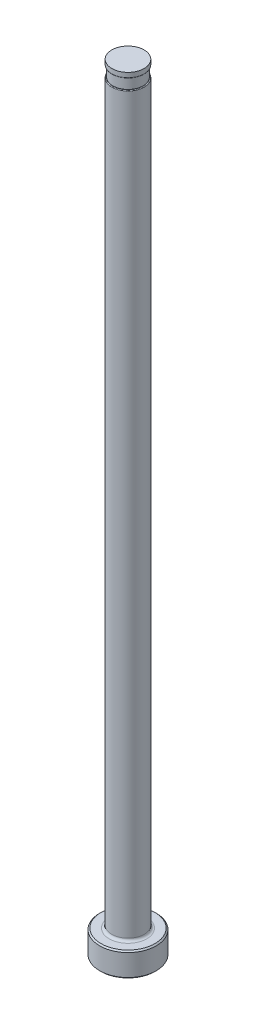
ISO-10303-21;
HEADER;
FILE_DESCRIPTION(('STEP AP214'),'2;1');
FILE_NAME('part.step','',(''),(''),'','','');
FILE_SCHEMA(('AUTOMOTIVE_DESIGN { 1 0 10303 214 1 1 1 1 }'));
ENDSEC;
DATA;
#1=APPLICATION_CONTEXT('core data for automotive mechanical design processes');
#2=APPLICATION_PROTOCOL_DEFINITION('international standard','automotive_design',2000,#1);
#3=PRODUCT_CONTEXT('',#1,'mechanical');
#4=PRODUCT('Part','Part','',(#3));
#5=PRODUCT_RELATED_PRODUCT_CATEGORY('part','',(#4));
#6=PRODUCT_DEFINITION_FORMATION('','',#4);
#7=PRODUCT_DEFINITION_CONTEXT('part definition',#1,'design');
#8=PRODUCT_DEFINITION('design','',#6,#7);
#9=PRODUCT_DEFINITION_SHAPE('','',#8);
#10=(LENGTH_UNIT() NAMED_UNIT(*) SI_UNIT(.MILLI.,.METRE.));
#11=(NAMED_UNIT(*) PLANE_ANGLE_UNIT() SI_UNIT($,.RADIAN.));
#12=(NAMED_UNIT(*) SI_UNIT($,.STERADIAN.) SOLID_ANGLE_UNIT());
#13=UNCERTAINTY_MEASURE_WITH_UNIT(LENGTH_MEASURE(1.E-05),#10,'distance_accuracy_value','');
#14=(GEOMETRIC_REPRESENTATION_CONTEXT(3) GLOBAL_UNCERTAINTY_ASSIGNED_CONTEXT((#13)) GLOBAL_UNIT_ASSIGNED_CONTEXT((#10,
#11,#12)) REPRESENTATION_CONTEXT('',''));
#15=CARTESIAN_POINT('',(0.,0.,0.));
#16=DIRECTION('',(0.,0.,1.));
#17=DIRECTION('',(1.,0.,0.));
#18=AXIS2_PLACEMENT_3D('',#15,#16,#17);
#19=CARTESIAN_POINT('',(-3.17499999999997,151.384,0.));
#20=DIRECTION('',(0.,1.,0.));
#21=DIRECTION('',(0.,0.,1.));
#22=AXIS2_PLACEMENT_3D('',#19,#20,#21);
#23=PLANE('',#22);
#24=CARTESIAN_POINT('',(0.,151.384,0.));
#25=DIRECTION('',(0.,1.,0.));
#26=DIRECTION('',(0.,0.,1.));
#27=AXIS2_PLACEMENT_3D('',#24,#25,#26);
#28=CIRCLE('',#27,3.04291999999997);
#29=CARTESIAN_POINT('',(0.,151.384,3.04291999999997));
#30=VERTEX_POINT('',#29);
#31=EDGE_CURVE('E11',#30,#30,#28,.F.);
#32=ORIENTED_EDGE('',*,*,#31,.T.);
#33=EDGE_LOOP('',(#32));
#34=FACE_BOUND('',#33,.T.);
#35=CARTESIAN_POINT('',(0.,151.384,0.));
#36=DIRECTION('',(0.,1.,0.));
#37=DIRECTION('',(0.,0.,1.));
#38=AXIS2_PLACEMENT_3D('',#35,#36,#37);
#39=CIRCLE('',#38,2.97179999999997);
#40=CARTESIAN_POINT('',(0.,151.384,2.97179999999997));
#41=VERTEX_POINT('',#40);
#42=EDGE_CURVE('E78',#41,#41,#39,.T.);
#43=ORIENTED_EDGE('',*,*,#42,.T.);
#44=EDGE_LOOP('',(#43));
#45=FACE_BOUND('',#44,.T.);
#46=ADVANCED_FACE('F36',(#34,#45),#23,.F.);
#47=CARTESIAN_POINT('',(0.,259.958771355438,0.));
#48=DIRECTION('',(0.,1.,0.));
#49=DIRECTION('',(0.,0.,1.));
#50=AXIS2_PLACEMENT_3D('',#47,#48,#49);
#51=CYLINDRICAL_SURFACE('',#50,3.17499999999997);
#52=DIRECTION('',(0.,1.,0.));
#53=VECTOR('',#52,1.);
#54=CARTESIAN_POINT('',(-2.97179999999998,259.958771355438,-1.11759999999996));
#55=LINE('',#54,#53);
#56=CARTESIAN_POINT('',(-2.97179999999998,149.225,-1.11759999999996));
#57=VERTEX_POINT('',#56);
#58=CARTESIAN_POINT('',(-2.97179999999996,86.868,-1.11760000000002));
#59=VERTEX_POINT('',#58);
#60=EDGE_CURVE('E73',#57,#59,#55,.F.);
#61=ORIENTED_EDGE('',*,*,#60,.F.);
#62=CARTESIAN_POINT('',(0.,149.225,0.));
#63=DIRECTION('',(0.,-1.,0.));
#64=DIRECTION('',(0.,0.,-1.));
#65=AXIS2_PLACEMENT_3D('',#62,#63,#64);
#66=CIRCLE('',#65,3.17499999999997);
#67=CARTESIAN_POINT('',(-2.97179999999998,149.225,1.11759999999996));
#68=VERTEX_POINT('',#67);
#69=EDGE_CURVE('E51',#57,#68,#66,.T.);
#70=ORIENTED_EDGE('',*,*,#69,.T.);
#71=DIRECTION('',(0.,1.,0.));
#72=VECTOR('',#71,1.);
#73=CARTESIAN_POINT('',(-2.97179999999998,259.958771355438,1.11759999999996));
#74=LINE('',#73,#72);
#75=CARTESIAN_POINT('',(-2.97179999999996,86.868,1.11760000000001));
#76=VERTEX_POINT('',#75);
#77=EDGE_CURVE('E84',#76,#68,#74,.T.);
#78=ORIENTED_EDGE('',*,*,#77,.F.);
#79=CARTESIAN_POINT('',(-2.97179999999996,86.868,-1.11760000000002));
#80=CARTESIAN_POINT('',(-2.97179783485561,86.8368492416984,-1.11759841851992));
#81=CARTESIAN_POINT('',(-2.97225900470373,86.8057131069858,-1.11638031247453));
#82=CARTESIAN_POINT('',(-2.97408412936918,86.7436581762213,-1.11151181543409));
#83=CARTESIAN_POINT('',(-2.9754480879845,86.7127393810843,-1.10786141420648));
#84=CARTESIAN_POINT('',(-2.98085437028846,86.6206586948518,-1.09327356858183));
#85=CARTESIAN_POINT('',(-2.98621120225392,86.5601035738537,-1.07869946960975));
#86=CARTESIAN_POINT('',(-2.99989040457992,86.4424361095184,-1.0400472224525));
#87=CARTESIAN_POINT('',(-3.0082151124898,86.385326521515,-1.01596158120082));
#88=CARTESIAN_POINT('',(-3.02694285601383,86.276241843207,-0.958720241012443));
#89=CARTESIAN_POINT('',(-3.03734492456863,86.2242643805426,-0.925568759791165));
#90=CARTESIAN_POINT('',(-3.05902445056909,86.1272383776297,-0.851164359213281));
#91=CARTESIAN_POINT('',(-3.07029576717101,86.082146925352,-0.809965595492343));
#92=CARTESIAN_POINT('',(-3.09254226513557,85.9996893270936,-0.720370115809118));
#93=CARTESIAN_POINT('',(-3.10351739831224,85.9623244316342,-0.671972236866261));
#94=CARTESIAN_POINT('',(-3.12390298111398,85.8964529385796,-0.5696942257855));
#95=CARTESIAN_POINT('',(-3.13332395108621,85.8678855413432,-0.51585530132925));
#96=CARTESIAN_POINT('',(-3.14970808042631,85.8198047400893,-0.403931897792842));
#97=CARTESIAN_POINT('',(-3.15667118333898,85.8002915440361,-0.345847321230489));
#98=CARTESIAN_POINT('',(-3.16748231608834,85.7704813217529,-0.226501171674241));
#99=CARTESIAN_POINT('',(-3.171300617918,85.7602721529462,-0.16521497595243));
#100=CARTESIAN_POINT('',(-3.17532797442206,85.7495133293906,-0.0416799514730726));
#101=CARTESIAN_POINT('',(-3.17553664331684,85.7489647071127,0.0205689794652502));
#102=CARTESIAN_POINT('',(-3.17230405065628,85.7575855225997,0.145017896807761));
#103=CARTESIAN_POINT('',(-3.16882082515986,85.7668666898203,0.207209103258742));
#104=CARTESIAN_POINT('',(-3.15849643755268,85.7952036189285,0.329033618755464));
#105=CARTESIAN_POINT('',(-3.15165544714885,85.8142588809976,0.388667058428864));
#106=CARTESIAN_POINT('',(-3.13536379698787,85.8617683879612,0.503459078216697));
#107=CARTESIAN_POINT('',(-3.12592155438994,85.8901923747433,0.558631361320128));
#108=CARTESIAN_POINT('',(-3.10544176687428,85.9558905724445,0.663093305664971));
#109=CARTESIAN_POINT('',(-3.0944044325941,85.9931636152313,0.712383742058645));
#110=CARTESIAN_POINT('',(-3.07210838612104,86.075112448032,0.803076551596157));
#111=CARTESIAN_POINT('',(-3.06085457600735,86.119683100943,0.844575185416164));
#112=CARTESIAN_POINT('',(-3.03920760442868,86.2153924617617,0.919437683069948));
#113=CARTESIAN_POINT('',(-3.02881454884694,86.266531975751,0.952800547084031));
#114=CARTESIAN_POINT('',(-3.01003274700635,86.3737633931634,1.01056985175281));
#115=CARTESIAN_POINT('',(-3.00163816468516,86.4298402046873,1.03500248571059));
#116=CARTESIAN_POINT('',(-2.987687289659,86.5454874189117,1.0746137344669));
#117=CARTESIAN_POINT('',(-2.98212915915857,86.6050555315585,1.08979834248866));
#118=CARTESIAN_POINT('',(-2.97612776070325,86.6989133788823,1.10603958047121));
#119=CARTESIAN_POINT('',(-2.97450869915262,86.732597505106,1.11037745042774));
#120=CARTESIAN_POINT('',(-2.9723439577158,86.8001830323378,1.11615426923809));
#121=CARTESIAN_POINT('',(-2.97179623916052,86.834083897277,1.11759872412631));
#122=CARTESIAN_POINT('',(-2.97179999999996,86.868,1.11760000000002));
#123=B_SPLINE_CURVE_WITH_KNOTS('',3,(#79,#80,#81,#82,#83,#84,#85,#86,#87,#88,#89,#90,#91,#92,
#93,#94,#95,#96,#97,#98,#99,#100,#101,#102,#103,#104,#105,#106,#107,#108,#109,#110,#111,#112,
#113,#114,#115,#116,#117,#118,#119,#120,#121,#122),.UNSPECIFIED.,.F.,.F.,(4,2,2,2,2,2,2,2,2,2,2,
2,2,2,2,2,2,2,2,2,2,4),(0.,0.0933958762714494,0.186792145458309,0.373380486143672,
0.56011611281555,0.746765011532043,0.932198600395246,1.11766217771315,1.30181365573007,
1.48596936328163,1.67184654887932,1.85774359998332,2.04577654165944,2.23379986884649,
2.42122179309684,2.60861899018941,2.79352185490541,2.97844743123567,3.16282616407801,
3.34708528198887,3.448962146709,3.55064495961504),.UNSPECIFIED.);
#124=EDGE_CURVE('E81',#59,#76,#123,.T.);
#125=ORIENTED_EDGE('',*,*,#124,.F.);
#126=EDGE_LOOP('',(#61,#70,#78,#125));
#127=FACE_BOUND('',#126,.T.);
#128=CARTESIAN_POINT('',(0.,5.25779999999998,0.));
#129=DIRECTION('',(0.,1.,0.));
#130=DIRECTION('',(0.,0.,1.));
#131=AXIS2_PLACEMENT_3D('',#128,#129,#130);
#132=CIRCLE('',#131,3.17499999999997);
#133=CARTESIAN_POINT('',(0.,5.25779999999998,3.17499999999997));
#134=VERTEX_POINT('',#133);
#135=EDGE_CURVE('E116',#134,#134,#132,.T.);
#136=ORIENTED_EDGE('',*,*,#135,.T.);
#137=EDGE_LOOP('',(#136));
#138=FACE_BOUND('',#137,.T.);
#139=ADVANCED_FACE('F82',(#127,#138),#51,.T.);
#140=CARTESIAN_POINT('',(0.,0.,0.));
#141=DIRECTION('',(0.,-1.,0.));
#142=DIRECTION('',(0.,0.,-1.));
#143=AXIS2_PLACEMENT_3D('',#140,#141,#142);
#144=PLANE('',#143);
#145=CARTESIAN_POINT('',(0.,0.,0.));
#146=DIRECTION('',(0.,-1.,0.));
#147=DIRECTION('',(0.,0.,-1.));
#148=AXIS2_PLACEMENT_3D('',#145,#146,#147);
#149=CIRCLE('',#148,5.29589999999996);
#150=CARTESIAN_POINT('',(0.,0.,-5.29589999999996));
#151=VERTEX_POINT('',#150);
#152=EDGE_CURVE('E113',#151,#151,#149,.T.);
#153=ORIENTED_EDGE('',*,*,#152,.T.);
#154=EDGE_LOOP('',(#153));
#155=FACE_BOUND('',#154,.T.);
#156=ADVANCED_FACE('F192',(#155),#144,.T.);
#157=CARTESIAN_POINT('',(0.,259.958771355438,0.));
#158=DIRECTION('',(0.,1.,0.));
#159=DIRECTION('',(0.,0.,1.));
#160=AXIS2_PLACEMENT_3D('',#157,#158,#159);
#161=CYLINDRICAL_SURFACE('',#160,5.54989999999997);
#162=CARTESIAN_POINT('',(0.,4.49579999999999,0.));
#163=DIRECTION('',(0.,1.,0.));
#164=DIRECTION('',(0.,0.,1.));
#165=AXIS2_PLACEMENT_3D('',#162,#163,#164);
#166=CIRCLE('',#165,5.54989999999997);
#167=CARTESIAN_POINT('',(0.,4.49579999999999,5.54989999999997));
#168=VERTEX_POINT('',#167);
#169=EDGE_CURVE('E110',#168,#168,#166,.F.);
#170=ORIENTED_EDGE('',*,*,#169,.T.);
#171=EDGE_LOOP('',(#170));
#172=FACE_BOUND('',#171,.T.);
#173=CARTESIAN_POINT('',(0.,0.253999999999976,0.));
#174=DIRECTION('',(0.,-1.,0.));
#175=DIRECTION('',(0.,0.,-1.));
#176=AXIS2_PLACEMENT_3D('',#173,#174,#175);
#177=CIRCLE('',#176,5.54989999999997);
#178=CARTESIAN_POINT('',(0.,0.253999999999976,-5.54989999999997));
#179=VERTEX_POINT('',#178);
#180=EDGE_CURVE('E107',#179,#179,#177,.F.);
#181=ORIENTED_EDGE('',*,*,#180,.T.);
#182=EDGE_LOOP('',(#181));
#183=FACE_BOUND('',#182,.T.);
#184=ADVANCED_FACE('F195',(#172,#183),#161,.T.);
#185=CARTESIAN_POINT('',(-5.54989999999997,4.7498,0.));
#186=DIRECTION('',(0.,1.,0.));
#187=DIRECTION('',(0.,0.,1.));
#188=AXIS2_PLACEMENT_3D('',#185,#186,#187);
#189=PLANE('',#188);
#190=CARTESIAN_POINT('',(0.,4.7498,0.));
#191=DIRECTION('',(0.,1.,0.));
#192=DIRECTION('',(0.,0.,1.));
#193=AXIS2_PLACEMENT_3D('',#190,#191,#192);
#194=CIRCLE('',#193,3.68299999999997);
#195=CARTESIAN_POINT('',(0.,4.7498,3.68299999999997));
#196=VERTEX_POINT('',#195);
#197=EDGE_CURVE('E87',#196,#196,#194,.F.);
#198=ORIENTED_EDGE('',*,*,#197,.T.);
#199=EDGE_LOOP('',(#198));
#200=FACE_BOUND('',#199,.T.);
#201=CARTESIAN_POINT('',(0.,4.7498,0.));
#202=DIRECTION('',(0.,1.,0.));
#203=DIRECTION('',(0.,0.,1.));
#204=AXIS2_PLACEMENT_3D('',#201,#202,#203);
#205=CIRCLE('',#204,5.29589999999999);
#206=CARTESIAN_POINT('',(0.,4.7498,5.29589999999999));
#207=VERTEX_POINT('',#206);
#208=EDGE_CURVE('E104',#207,#207,#205,.T.);
#209=ORIENTED_EDGE('',*,*,#208,.T.);
#210=EDGE_LOOP('',(#209));
#211=FACE_BOUND('',#210,.T.);
#212=ADVANCED_FACE('F190',(#200,#211),#189,.T.);
#213=CARTESIAN_POINT('',(0.,4.74980000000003,0.));
#214=DIRECTION('',(0.,-1.,0.));
#215=DIRECTION('',(0.,0.,-1.));
#216=AXIS2_PLACEMENT_3D('',#213,#214,#215);
#217=CONICAL_SURFACE('',#216,5.29589999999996,0.785398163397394);
#218=ORIENTED_EDGE('',*,*,#169,.F.);
#219=EDGE_LOOP('',(#218));
#220=FACE_BOUND('',#219,.T.);
#221=ORIENTED_EDGE('',*,*,#208,.F.);
#222=EDGE_LOOP('',(#221));
#223=FACE_BOUND('',#222,.T.);
#224=ADVANCED_FACE('F186',(#220,#223),#217,.T.);
#225=CARTESIAN_POINT('',(0.,0.253999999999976,0.));
#226=DIRECTION('',(0.,1.,0.));
#227=DIRECTION('',(0.,0.,1.));
#228=AXIS2_PLACEMENT_3D('',#225,#226,#227);
#229=CONICAL_SURFACE('',#228,5.54989999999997,0.785398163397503);
#230=ORIENTED_EDGE('',*,*,#152,.F.);
#231=EDGE_LOOP('',(#230));
#232=FACE_BOUND('',#231,.T.);
#233=ORIENTED_EDGE('',*,*,#180,.F.);
#234=EDGE_LOOP('',(#233));
#235=FACE_BOUND('',#234,.T.);
#236=ADVANCED_FACE('F182',(#232,#235),#229,.T.);
#237=CARTESIAN_POINT('',(0.,5.25779999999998,0.));
#238=DIRECTION('',(0.,1.,0.));
#239=DIRECTION('',(0.,0.,1.));
#240=AXIS2_PLACEMENT_3D('',#237,#238,#239);
#241=TOROIDAL_SURFACE('',#240,3.68299999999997,0.508);
#242=ORIENTED_EDGE('',*,*,#197,.F.);
#243=EDGE_LOOP('',(#242));
#244=FACE_BOUND('',#243,.T.);
#245=ORIENTED_EDGE('',*,*,#135,.F.);
#246=EDGE_LOOP('',(#245));
#247=FACE_BOUND('',#246,.T.);
#248=ADVANCED_FACE('F147',(#244,#247),#241,.F.);
#249=CARTESIAN_POINT('',(-3.17499999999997,149.352,0.));
#250=DIRECTION('',(0.,-1.,0.));
#251=DIRECTION('',(0.,0.,-1.));
#252=AXIS2_PLACEMENT_3D('',#249,#250,#251);
#253=PLANE('',#252);
#254=DIRECTION('',(0.,0.,1.));
#255=VECTOR('',#254,1.);
#256=CARTESIAN_POINT('',(-2.97179999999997,149.352,0.));
#257=LINE('',#256,#255);
#258=CARTESIAN_POINT('',(-2.97179999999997,149.352,0.));
#259=VERTEX_POINT('',#258);
#260=CARTESIAN_POINT('',(-2.97179999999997,149.352,0.677280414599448));
#261=VERTEX_POINT('',#260);
#262=EDGE_CURVE('E90',#259,#261,#257,.T.);
#263=ORIENTED_EDGE('',*,*,#262,.T.);
#264=CARTESIAN_POINT('',(0.,149.352,0.));
#265=DIRECTION('',(0.,-1.,0.));
#266=DIRECTION('',(0.,0.,-1.));
#267=AXIS2_PLACEMENT_3D('',#264,#265,#266);
#268=CIRCLE('',#267,3.04799999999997);
#269=CARTESIAN_POINT('',(-2.97179999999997,149.352,-0.677280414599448));
#270=VERTEX_POINT('',#269);
#271=EDGE_CURVE('E86',#261,#270,#268,.F.);
#272=ORIENTED_EDGE('',*,*,#271,.T.);
#273=EDGE_CURVE('E79',#270,#259,#257,.T.);
#274=ORIENTED_EDGE('',*,*,#273,.T.);
#275=CARTESIAN_POINT('',(0.,149.352,0.));
#276=DIRECTION('',(0.,1.,0.));
#277=DIRECTION('',(0.,0.,1.));
#278=AXIS2_PLACEMENT_3D('',#275,#276,#277);
#279=CIRCLE('',#278,2.97179999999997);
#280=EDGE_CURVE('E101',#259,#259,#279,.T.);
#281=ORIENTED_EDGE('',*,*,#280,.F.);
#282=EDGE_LOOP('',(#263,#272,#274,#281));
#283=FACE_BOUND('',#282,.T.);
#284=ADVANCED_FACE('F144',(#283),#253,.F.);
#285=CARTESIAN_POINT('',(0.,153.448281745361,0.));
#286=DIRECTION('',(0.,1.,0.));
#287=DIRECTION('',(0.,0.,1.));
#288=AXIS2_PLACEMENT_3D('',#285,#286,#287);
#289=CYLINDRICAL_SURFACE('',#288,2.97179999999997);
#290=ORIENTED_EDGE('',*,*,#42,.F.);
#291=EDGE_LOOP('',(#290));
#292=FACE_BOUND('',#291,.T.);
#293=ORIENTED_EDGE('',*,*,#280,.T.);
#294=EDGE_LOOP('',(#293));
#295=FACE_BOUND('',#294,.T.);
#296=ADVANCED_FACE('F141',(#292,#295),#289,.T.);
#297=CARTESIAN_POINT('',(-2.97179999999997,150.368,-5.54989999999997));
#298=DIRECTION('',(1.,0.,0.));
#299=DIRECTION('',(0.,1.,0.));
#300=AXIS2_PLACEMENT_3D('',#297,#298,#299);
#301=PLANE('',#300);
#302=ORIENTED_EDGE('',*,*,#273,.F.);
#303=CARTESIAN_POINT('',(-2.97179999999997,149.352,-0.677280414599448));
#304=CARTESIAN_POINT('',(-2.97179999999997,149.351991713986,-0.698495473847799));
#305=CARTESIAN_POINT('',(-2.97179999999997,149.351736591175,-0.719716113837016));
#306=CARTESIAN_POINT('',(-2.97179999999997,149.350538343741,-0.762179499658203));
#307=CARTESIAN_POINT('',(-2.97179999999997,149.349593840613,-0.78342220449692));
#308=CARTESIAN_POINT('',(-2.97179999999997,149.346820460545,-0.825863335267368));
#309=CARTESIAN_POINT('',(-2.97179999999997,149.344991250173,-0.847061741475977));
#310=CARTESIAN_POINT('',(-2.97179999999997,149.340151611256,-0.889310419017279));
#311=CARTESIAN_POINT('',(-2.97179999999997,149.337141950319,-0.910360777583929));
#312=CARTESIAN_POINT('',(-2.97179999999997,149.329222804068,-0.953695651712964));
#313=CARTESIAN_POINT('',(-2.97179999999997,149.324192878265,-0.975960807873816));
#314=CARTESIAN_POINT('',(-2.97179999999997,149.314052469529,-1.00993113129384));
#315=CARTESIAN_POINT('',(-2.97179999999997,149.309967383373,-1.02193961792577));
#316=CARTESIAN_POINT('',(-2.97179999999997,149.300509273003,-1.04542724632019));
#317=CARTESIAN_POINT('',(-2.97179999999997,149.295141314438,-1.0569082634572));
#318=CARTESIAN_POINT('',(-2.97179999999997,149.286361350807,-1.07197645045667));
#319=CARTESIAN_POINT('',(-2.97179999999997,149.283794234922,-1.07605240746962));
#320=CARTESIAN_POINT('',(-2.97179999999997,149.278297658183,-1.08396863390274));
#321=CARTESIAN_POINT('',(-2.97179999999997,149.275367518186,-1.08780844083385));
#322=CARTESIAN_POINT('',(-2.97179999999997,149.269038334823,-1.09516229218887));
#323=CARTESIAN_POINT('',(-2.97179999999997,149.26563441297,-1.09867221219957));
#324=CARTESIAN_POINT('',(-2.97179999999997,149.258296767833,-1.10509067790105));
#325=CARTESIAN_POINT('',(-2.97179999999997,149.254365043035,-1.10800139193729));
#326=CARTESIAN_POINT('',(-2.97179999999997,149.247688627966,-1.11185537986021));
#327=CARTESIAN_POINT('',(-2.97179999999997,149.245127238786,-1.11311410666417));
#328=CARTESIAN_POINT('',(-2.97179999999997,149.239839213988,-1.11520642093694));
#329=CARTESIAN_POINT('',(-2.97179999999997,149.237113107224,-1.11604129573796));
#330=CARTESIAN_POINT('',(-2.97179999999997,149.23280351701,-1.11694468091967));
#331=CARTESIAN_POINT('',(-2.97179999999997,149.231255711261,-1.11718896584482));
#332=CARTESIAN_POINT('',(-2.97179999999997,149.228139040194,-1.11751723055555));
#333=CARTESIAN_POINT('',(-2.97179999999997,149.226570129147,-1.11760077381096));
#334=CARTESIAN_POINT('',(-2.97179999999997,149.225,-1.11760000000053));
#335=B_SPLINE_CURVE_WITH_KNOTS('',3,(#303,#304,#305,#306,#307,#308,#309,#310,#311,#312,#313,
#314,#315,#316,#317,#318,#319,#320,#321,#322,#323,#324,#325,#326,#327,#328,#329,#330,#331,#332,
#333,#334),.UNSPECIFIED.,.F.,.F.,(4,2,2,2,2,2,2,2,2,2,2,2,2,2,2,4),(0.,0.0636519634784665,
0.127431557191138,0.191235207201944,0.254997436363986,0.32331819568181,0.361333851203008,
0.39920180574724,0.413638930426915,0.428103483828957,0.442729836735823,0.457302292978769,
0.465835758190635,0.474343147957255,0.479036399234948,0.483742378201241),.UNSPECIFIED.);
#336=EDGE_CURVE('E59',#270,#57,#335,.T.);
#337=ORIENTED_EDGE('',*,*,#336,.T.);
#338=ORIENTED_EDGE('',*,*,#60,.T.);
#339=DIRECTION('',(0.,0.,1.));
#340=VECTOR('',#339,1.);
#341=CARTESIAN_POINT('',(-2.97179999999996,86.868,-5.54989999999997));
#342=LINE('',#341,#340);
#343=EDGE_CURVE('E77',#59,#76,#342,.T.);
#344=ORIENTED_EDGE('',*,*,#343,.T.);
#345=ORIENTED_EDGE('',*,*,#77,.T.);
#346=CARTESIAN_POINT('',(-2.97179999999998,149.225,1.11759999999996));
#347=CARTESIAN_POINT('',(-2.97179999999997,149.227844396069,1.11760835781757));
#348=CARTESIAN_POINT('',(-2.97179999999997,149.23067736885,1.11732895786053));
#349=CARTESIAN_POINT('',(-2.97179999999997,149.236214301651,1.11627315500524));
#350=CARTESIAN_POINT('',(-2.97179999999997,149.238919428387,1.11550297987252));
#351=CARTESIAN_POINT('',(-2.97179999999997,149.244802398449,1.11330388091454));
#352=CARTESIAN_POINT('',(-2.97179999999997,149.247936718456,1.11176081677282));
#353=CARTESIAN_POINT('',(-2.97179999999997,149.25392747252,1.10819062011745));
#354=CARTESIAN_POINT('',(-2.97179999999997,149.256782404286,1.10616105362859));
#355=CARTESIAN_POINT('',(-2.97179999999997,149.264003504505,1.10031059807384));
#356=CARTESIAN_POINT('',(-2.97179999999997,149.268124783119,1.09619100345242));
#357=CARTESIAN_POINT('',(-2.97179999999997,149.275733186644,1.0874137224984));
#358=CARTESIAN_POINT('',(-2.97179999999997,149.279218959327,1.08275492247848));
#359=CARTESIAN_POINT('',(-2.97179999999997,149.290988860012,1.06527198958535));
#360=CARTESIAN_POINT('',(-2.97179999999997,149.297843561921,1.0515049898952));
#361=CARTESIAN_POINT('',(-2.97179999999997,149.309670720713,1.02308851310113));
#362=CARTESIAN_POINT('',(-2.97179999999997,149.314618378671,1.00843010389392));
#363=CARTESIAN_POINT('',(-2.97179999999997,149.326630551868,0.96688378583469));
#364=CARTESIAN_POINT('',(-2.97179999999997,149.332231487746,0.939575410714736));
#365=CARTESIAN_POINT('',(-2.97179999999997,149.340982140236,0.884515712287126));
#366=CARTESIAN_POINT('',(-2.97179999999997,149.344121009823,0.856762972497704));
#367=CARTESIAN_POINT('',(-2.97179999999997,149.348504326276,0.803619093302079));
#368=CARTESIAN_POINT('',(-2.97179999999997,149.349893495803,0.778239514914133));
#369=CARTESIAN_POINT('',(-2.97179999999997,149.351627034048,0.727660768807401));
#370=CARTESIAN_POINT('',(-2.97179999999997,149.351980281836,0.702461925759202));
#371=CARTESIAN_POINT('',(-2.97179999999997,149.352,0.67728041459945));
#372=B_SPLINE_CURVE_WITH_KNOTS('',3,(#346,#347,#348,#349,#350,#351,#352,#353,#354,#355,#356,
#357,#358,#359,#360,#361,#362,#363,#364,#365,#366,#367,#368,#369,#370,#371),.UNSPECIFIED.,.F.,
.F.,(4,2,2,2,2,2,2,2,2,2,2,2,4),(0.,0.0085011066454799,0.0168964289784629,0.0273183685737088,
0.0377935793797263,0.0551763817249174,0.0725957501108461,0.11838052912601,0.164742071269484,
0.248117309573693,0.331857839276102,0.408083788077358,0.483654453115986),.UNSPECIFIED.);
#373=EDGE_CURVE('E172',#68,#261,#372,.T.);
#374=ORIENTED_EDGE('',*,*,#373,.T.);
#375=ORIENTED_EDGE('',*,*,#262,.F.);
#376=EDGE_LOOP('',(#302,#337,#338,#344,#345,#374,#375));
#377=FACE_BOUND('',#376,.T.);
#378=ADVANCED_FACE('F75',(#377),#301,.F.);
#379=CARTESIAN_POINT('',(-6.14679999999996,86.868,-5.54989999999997));
#380=DIRECTION('',(0.,0.,1.));
#381=DIRECTION('',(1.,0.,0.));
#382=AXIS2_PLACEMENT_3D('',#379,#380,#381);
#383=CYLINDRICAL_SURFACE('',#382,3.175);
#384=ORIENTED_EDGE('',*,*,#343,.F.);
#385=ORIENTED_EDGE('',*,*,#124,.T.);
#386=EDGE_LOOP('',(#384,#385));
#387=FACE_BOUND('',#386,.T.);
#388=ADVANCED_FACE('F89',(#387),#383,.F.);
#389=CARTESIAN_POINT('',(0.,152.687735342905,0.));
#390=DIRECTION('',(0.,1.,0.));
#391=DIRECTION('',(0.,0.,1.));
#392=AXIS2_PLACEMENT_3D('',#389,#390,#391);
#393=CYLINDRICAL_SURFACE('',#392,3.16991999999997);
#394=CARTESIAN_POINT('',(0.,151.511,0.));
#395=DIRECTION('',(0.,1.,0.));
#396=DIRECTION('',(0.,0.,1.));
#397=AXIS2_PLACEMENT_3D('',#394,#395,#396);
#398=CIRCLE('',#397,3.16991999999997);
#399=CARTESIAN_POINT('',(0.,151.511,3.16991999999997));
#400=VERTEX_POINT('',#399);
#401=EDGE_CURVE('E44',#400,#400,#398,.T.);
#402=ORIENTED_EDGE('',*,*,#401,.T.);
#403=EDGE_LOOP('',(#402));
#404=FACE_BOUND('',#403,.T.);
#405=CARTESIAN_POINT('',(0.,152.4,0.));
#406=DIRECTION('',(0.,1.,0.));
#407=DIRECTION('',(0.,0.,1.));
#408=AXIS2_PLACEMENT_3D('',#405,#406,#407);
#409=CIRCLE('',#408,3.16991999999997);
#410=CARTESIAN_POINT('',(0.,152.4,3.16991999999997));
#411=VERTEX_POINT('',#410);
#412=EDGE_CURVE('E91',#411,#411,#409,.T.);
#413=ORIENTED_EDGE('',*,*,#412,.F.);
#414=EDGE_LOOP('',(#413));
#415=FACE_BOUND('',#414,.T.);
#416=ADVANCED_FACE('F135',(#404,#415),#393,.T.);
#417=CARTESIAN_POINT('',(-3.17499999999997,152.4,0.));
#418=DIRECTION('',(0.,1.,0.));
#419=DIRECTION('',(0.,0.,1.));
#420=AXIS2_PLACEMENT_3D('',#417,#418,#419);
#421=PLANE('',#420);
#422=ORIENTED_EDGE('',*,*,#412,.T.);
#423=EDGE_LOOP('',(#422));
#424=FACE_BOUND('',#423,.T.);
#425=ADVANCED_FACE('F149',(#424),#421,.T.);
#426=CARTESIAN_POINT('',(0.,149.225,0.));
#427=DIRECTION('',(0.,-1.,0.));
#428=DIRECTION('',(0.,0.,-1.));
#429=AXIS2_PLACEMENT_3D('',#426,#427,#428);
#430=TOROIDAL_SURFACE('',#429,3.04799999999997,0.127);
#431=ORIENTED_EDGE('',*,*,#373,.F.);
#432=ORIENTED_EDGE('',*,*,#69,.F.);
#433=ORIENTED_EDGE('',*,*,#336,.F.);
#434=ORIENTED_EDGE('',*,*,#271,.F.);
#435=EDGE_LOOP('',(#431,#432,#433,#434));
#436=FACE_BOUND('',#435,.T.);
#437=ADVANCED_FACE('F151',(#436),#430,.T.);
#438=CARTESIAN_POINT('',(0.,151.511,0.));
#439=DIRECTION('',(0.,1.,0.));
#440=DIRECTION('',(0.,0.,1.));
#441=AXIS2_PLACEMENT_3D('',#438,#439,#440);
#442=TOROIDAL_SURFACE('',#441,3.04291999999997,0.127);
#443=ORIENTED_EDGE('',*,*,#31,.F.);
#444=EDGE_LOOP('',(#443));
#445=FACE_BOUND('',#444,.T.);
#446=ORIENTED_EDGE('',*,*,#401,.F.);
#447=EDGE_LOOP('',(#446));
#448=FACE_BOUND('',#447,.T.);
#449=ADVANCED_FACE('F38',(#445,#448),#442,.T.);
#450=CLOSED_SHELL('',(#46,#139,#156,#184,#212,#224,#236,#248,#284,#296,#378,#388,#416,#425,#437,#449));
#451=MANIFOLD_SOLID_BREP('B2',#450);
#452=ADVANCED_BREP_SHAPE_REPRESENTATION('',(#18,#451),#14);
#453=SHAPE_DEFINITION_REPRESENTATION(#9,#452);
ENDSEC;
END-ISO-10303-21;
